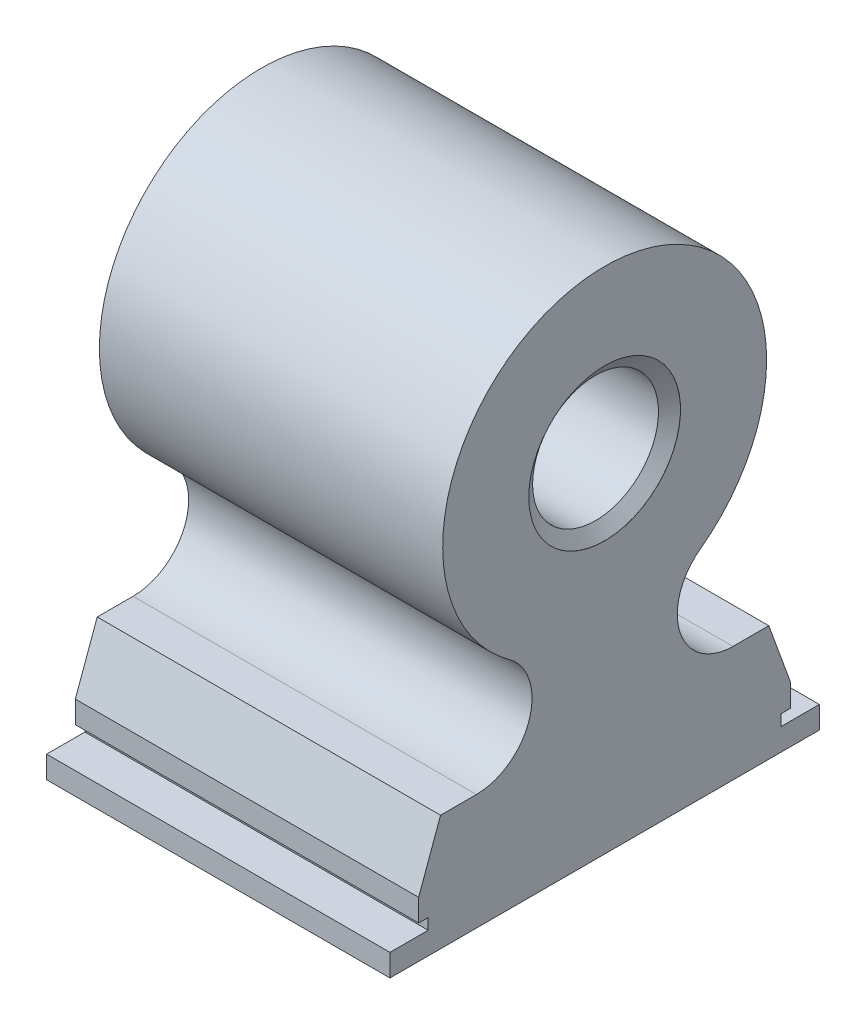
ISO-10303-21;
HEADER;
FILE_DESCRIPTION(('STEP AP214'),'2;1');
FILE_NAME('part.step','',(''),(''),'','','');
FILE_SCHEMA(('AUTOMOTIVE_DESIGN { 1 0 10303 214 1 1 1 1 }'));
ENDSEC;
DATA;
#1=APPLICATION_CONTEXT('core data for automotive mechanical design processes');
#2=APPLICATION_PROTOCOL_DEFINITION('international standard','automotive_design',2000,#1);
#3=PRODUCT_CONTEXT('',#1,'mechanical');
#4=PRODUCT('Part','Part','',(#3));
#5=PRODUCT_RELATED_PRODUCT_CATEGORY('part','',(#4));
#6=PRODUCT_DEFINITION_FORMATION('','',#4);
#7=PRODUCT_DEFINITION_CONTEXT('part definition',#1,'design');
#8=PRODUCT_DEFINITION('design','',#6,#7);
#9=PRODUCT_DEFINITION_SHAPE('','',#8);
#10=(LENGTH_UNIT() NAMED_UNIT(*) SI_UNIT(.MILLI.,.METRE.));
#11=(NAMED_UNIT(*) PLANE_ANGLE_UNIT() SI_UNIT($,.RADIAN.));
#12=(NAMED_UNIT(*) SI_UNIT($,.STERADIAN.) SOLID_ANGLE_UNIT());
#13=UNCERTAINTY_MEASURE_WITH_UNIT(LENGTH_MEASURE(1.E-05),#10,'distance_accuracy_value','');
#14=(GEOMETRIC_REPRESENTATION_CONTEXT(3) GLOBAL_UNCERTAINTY_ASSIGNED_CONTEXT((#13)) GLOBAL_UNIT_ASSIGNED_CONTEXT((#10,
#11,#12)) REPRESENTATION_CONTEXT('',''));
#15=CARTESIAN_POINT('',(0.,0.,0.));
#16=DIRECTION('',(0.,0.,1.));
#17=DIRECTION('',(1.,0.,0.));
#18=AXIS2_PLACEMENT_3D('',#15,#16,#17);
#19=CARTESIAN_POINT('',(9.4234,0.,0.));
#20=DIRECTION('',(-1.,0.,0.));
#21=DIRECTION('',(0.,0.,1.));
#22=AXIS2_PLACEMENT_3D('',#19,#20,#21);
#23=CYLINDRICAL_SURFACE('',#22,1.7272);
#24=CARTESIAN_POINT('',(0.251441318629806,0.,0.));
#25=DIRECTION('',(-1.,0.,0.));
#26=DIRECTION('',(0.,0.,1.));
#27=AXIS2_PLACEMENT_3D('',#24,#25,#26);
#28=CIRCLE('',#27,1.7272);
#29=CARTESIAN_POINT('',(0.251441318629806,0.,1.7272));
#30=VERTEX_POINT('',#29);
#31=EDGE_CURVE('E274',#30,#30,#28,.T.);
#32=ORIENTED_EDGE('',*,*,#31,.T.);
#33=EDGE_LOOP('',(#32));
#34=FACE_BOUND('',#33,.T.);
#35=CARTESIAN_POINT('',(9.17195868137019,0.,0.));
#36=DIRECTION('',(-1.,0.,0.));
#37=DIRECTION('',(0.,0.,1.));
#38=AXIS2_PLACEMENT_3D('',#35,#36,#37);
#39=CIRCLE('',#38,1.7272);
#40=CARTESIAN_POINT('',(9.17195868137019,0.,1.7272));
#41=VERTEX_POINT('',#40);
#42=EDGE_CURVE('E472',#41,#41,#39,.T.);
#43=ORIENTED_EDGE('',*,*,#42,.F.);
#44=EDGE_LOOP('',(#43));
#45=FACE_BOUND('',#44,.T.);
#46=ADVANCED_FACE('F33',(#34,#45),#23,.F.);
#47=CARTESIAN_POINT('',(9.4234,-4.82346177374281,3.52043822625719));
#48=DIRECTION('',(-1.,0.,0.));
#49=DIRECTION('',(0.,0.,1.));
#50=AXIS2_PLACEMENT_3D('',#47,#48,#49);
#51=PLANE('',#50);
#52=DIRECTION('',(0.,-1.,0.));
#53=VECTOR('',#52,1.);
#54=CARTESIAN_POINT('',(9.4234,-9.525,5.8928));
#55=LINE('',#54,#53);
#56=CARTESIAN_POINT('',(9.4234,-8.9154,5.8928));
#57=VERTEX_POINT('',#56);
#58=CARTESIAN_POINT('',(9.4234,-9.525,5.8928));
#59=VERTEX_POINT('',#58);
#60=EDGE_CURVE('E228',#57,#59,#55,.T.);
#61=ORIENTED_EDGE('',*,*,#60,.T.);
#62=DIRECTION('',(0.,0.,-1.));
#63=VECTOR('',#62,1.);
#64=CARTESIAN_POINT('',(9.4234,-9.525,5.8928));
#65=LINE('',#64,#63);
#66=CARTESIAN_POINT('',(9.4234,-9.525,-5.8928));
#67=VERTEX_POINT('',#66);
#68=EDGE_CURVE('E125',#59,#67,#65,.T.);
#69=ORIENTED_EDGE('',*,*,#68,.T.);
#70=DIRECTION('',(0.,1.,0.));
#71=VECTOR('',#70,1.);
#72=CARTESIAN_POINT('',(9.4234,-9.525,-5.8928));
#73=LINE('',#72,#71);
#74=CARTESIAN_POINT('',(9.4234,-8.9154,-5.8928));
#75=VERTEX_POINT('',#74);
#76=EDGE_CURVE('E284',#67,#75,#73,.T.);
#77=ORIENTED_EDGE('',*,*,#76,.T.);
#78=DIRECTION('',(0.,0.,1.));
#79=VECTOR('',#78,1.);
#80=CARTESIAN_POINT('',(9.4234,-8.9154,-5.8928));
#81=LINE('',#80,#79);
#82=CARTESIAN_POINT('',(9.4234,-8.9154,-4.84293333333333));
#83=VERTEX_POINT('',#82);
#84=EDGE_CURVE('E286',#75,#83,#81,.T.);
#85=ORIENTED_EDGE('',*,*,#84,.T.);
#86=DIRECTION('',(0.,1.,0.));
#87=VECTOR('',#86,1.);
#88=CARTESIAN_POINT('',(9.4234,-8.9154,-4.84293333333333));
#89=LINE('',#88,#87);
#90=CARTESIAN_POINT('',(9.4234,-8.6106,-4.84293333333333));
#91=VERTEX_POINT('',#90);
#92=EDGE_CURVE('E288',#83,#91,#89,.T.);
#93=ORIENTED_EDGE('',*,*,#92,.T.);
#94=DIRECTION('',(0.,0.,-1.));
#95=VECTOR('',#94,1.);
#96=CARTESIAN_POINT('',(9.4234,-8.6106,-4.84293333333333));
#97=LINE('',#96,#95);
#98=CARTESIAN_POINT('',(9.4234,-8.6106,-5.1054));
#99=VERTEX_POINT('',#98);
#100=EDGE_CURVE('E290',#91,#99,#97,.T.);
#101=ORIENTED_EDGE('',*,*,#100,.T.);
#102=DIRECTION('',(0.,1.,0.));
#103=VECTOR('',#102,1.);
#104=CARTESIAN_POINT('',(9.4234,-8.001,-5.1054));
#105=LINE('',#104,#103);
#106=CARTESIAN_POINT('',(9.4234,-8.001,-5.1054));
#107=VERTEX_POINT('',#106);
#108=EDGE_CURVE('E292',#99,#107,#105,.T.);
#109=ORIENTED_EDGE('',*,*,#108,.T.);
#110=DIRECTION('',(0.,0.939692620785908,0.34202014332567));
#111=VECTOR('',#110,1.);
#112=CARTESIAN_POINT('',(9.4234,-6.35,-4.5044851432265));
#113=LINE('',#112,#111);
#114=CARTESIAN_POINT('',(9.4234,-6.35,-4.5044851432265));
#115=VERTEX_POINT('',#114);
#116=EDGE_CURVE('E294',#107,#115,#113,.T.);
#117=ORIENTED_EDGE('',*,*,#116,.T.);
#118=DIRECTION('',(0.,0.,1.));
#119=VECTOR('',#118,1.);
#120=CARTESIAN_POINT('',(9.4234,-6.35,-4.5044851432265));
#121=LINE('',#120,#119);
#122=CARTESIAN_POINT('',(9.4234,-6.35,-3.52043822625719));
#123=VERTEX_POINT('',#122);
#124=EDGE_CURVE('E296',#115,#123,#121,.T.);
#125=ORIENTED_EDGE('',*,*,#124,.T.);
#126=CARTESIAN_POINT('',(9.4234,-4.82346177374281,-3.52043822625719));
#127=DIRECTION('',(-1.,0.,0.));
#128=DIRECTION('',(0.,0.,1.));
#129=AXIS2_PLACEMENT_3D('',#126,#127,#128);
#130=CIRCLE('',#129,1.5265382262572);
#131=CARTESIAN_POINT('',(9.4234,-3.59041285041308,-2.62048861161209));
#132=VERTEX_POINT('',#131);
#133=EDGE_CURVE('E298',#123,#132,#130,.T.);
#134=ORIENTED_EDGE('',*,*,#133,.T.);
#135=CARTESIAN_POINT('',(9.4234,0.,0.));
#136=DIRECTION('',(1.,0.,0.));
#137=DIRECTION('',(0.,0.,-1.));
#138=AXIS2_PLACEMENT_3D('',#135,#136,#137);
#139=CIRCLE('',#138,4.445);
#140=CARTESIAN_POINT('',(9.4234,-3.59041285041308,2.62048861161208));
#141=VERTEX_POINT('',#140);
#142=EDGE_CURVE('E300',#132,#141,#139,.T.);
#143=ORIENTED_EDGE('',*,*,#142,.T.);
#144=CARTESIAN_POINT('',(9.4234,-4.82346177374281,3.52043822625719));
#145=DIRECTION('',(-1.,0.,0.));
#146=DIRECTION('',(0.,0.,1.));
#147=AXIS2_PLACEMENT_3D('',#144,#145,#146);
#148=CIRCLE('',#147,1.5265382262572);
#149=CARTESIAN_POINT('',(9.4234,-6.35,3.52043822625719));
#150=VERTEX_POINT('',#149);
#151=EDGE_CURVE('E302',#141,#150,#148,.T.);
#152=ORIENTED_EDGE('',*,*,#151,.T.);
#153=DIRECTION('',(0.,0.,1.));
#154=VECTOR('',#153,1.);
#155=CARTESIAN_POINT('',(9.4234,-6.35,3.52043822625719));
#156=LINE('',#155,#154);
#157=CARTESIAN_POINT('',(9.4234,-6.35,4.5044851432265));
#158=VERTEX_POINT('',#157);
#159=EDGE_CURVE('E304',#150,#158,#156,.T.);
#160=ORIENTED_EDGE('',*,*,#159,.T.);
#161=DIRECTION('',(0.,-0.939692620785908,0.34202014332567));
#162=VECTOR('',#161,1.);
#163=CARTESIAN_POINT('',(9.4234,-6.35,4.5044851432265));
#164=LINE('',#163,#162);
#165=CARTESIAN_POINT('',(9.4234,-8.001,5.1054));
#166=VERTEX_POINT('',#165);
#167=EDGE_CURVE('E306',#158,#166,#164,.T.);
#168=ORIENTED_EDGE('',*,*,#167,.T.);
#169=DIRECTION('',(0.,-1.,0.));
#170=VECTOR('',#169,1.);
#171=CARTESIAN_POINT('',(9.4234,-8.001,5.1054));
#172=LINE('',#171,#170);
#173=CARTESIAN_POINT('',(9.4234,-8.6106,5.1054));
#174=VERTEX_POINT('',#173);
#175=EDGE_CURVE('E175',#166,#174,#172,.T.);
#176=ORIENTED_EDGE('',*,*,#175,.T.);
#177=DIRECTION('',(0.,0.,-1.));
#178=VECTOR('',#177,1.);
#179=CARTESIAN_POINT('',(9.4234,-8.6106,4.84293333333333));
#180=LINE('',#179,#178);
#181=CARTESIAN_POINT('',(9.4234,-8.6106,4.84293333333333));
#182=VERTEX_POINT('',#181);
#183=EDGE_CURVE('E168',#174,#182,#180,.T.);
#184=ORIENTED_EDGE('',*,*,#183,.T.);
#185=DIRECTION('',(0.,-1.,0.));
#186=VECTOR('',#185,1.);
#187=CARTESIAN_POINT('',(9.4234,-8.9154,4.84293333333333));
#188=LINE('',#187,#186);
#189=CARTESIAN_POINT('',(9.4234,-8.9154,4.84293333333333));
#190=VERTEX_POINT('',#189);
#191=EDGE_CURVE('E173',#182,#190,#188,.T.);
#192=ORIENTED_EDGE('',*,*,#191,.T.);
#193=DIRECTION('',(0.,0.,1.));
#194=VECTOR('',#193,1.);
#195=CARTESIAN_POINT('',(9.4234,-8.9154,5.8928));
#196=LINE('',#195,#194);
#197=EDGE_CURVE('E52',#190,#57,#196,.T.);
#198=ORIENTED_EDGE('',*,*,#197,.T.);
#199=EDGE_LOOP('',(#61,#69,#77,#85,#93,#101,#109,#117,#125,#134,#143,#152,#160,#168,#176,#184,
#192,#198));
#200=FACE_BOUND('',#199,.T.);
#201=CARTESIAN_POINT('',(9.4234,0.,0.));
#202=DIRECTION('',(-1.,0.,0.));
#203=DIRECTION('',(0.,0.,1.));
#204=AXIS2_PLACEMENT_3D('',#201,#202,#203);
#205=CIRCLE('',#204,2.0828);
#206=CARTESIAN_POINT('',(9.4234,0.,2.0828));
#207=VERTEX_POINT('',#206);
#208=EDGE_CURVE('E37',#207,#207,#205,.F.);
#209=ORIENTED_EDGE('',*,*,#208,.F.);
#210=EDGE_LOOP('',(#209));
#211=FACE_BOUND('',#210,.T.);
#212=ADVANCED_FACE('F170',(#200,#211),#51,.F.);
#213=CARTESIAN_POINT('',(0.,-4.82346177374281,3.52043822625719));
#214=DIRECTION('',(-1.,0.,0.));
#215=DIRECTION('',(0.,0.,1.));
#216=AXIS2_PLACEMENT_3D('',#213,#214,#215);
#217=PLANE('',#216);
#218=DIRECTION('',(0.,-1.,0.));
#219=VECTOR('',#218,1.);
#220=CARTESIAN_POINT('',(0.,-9.525,5.8928));
#221=LINE('',#220,#219);
#222=CARTESIAN_POINT('',(0.,-8.9154,5.8928));
#223=VERTEX_POINT('',#222);
#224=CARTESIAN_POINT('',(0.,-9.525,5.8928));
#225=VERTEX_POINT('',#224);
#226=EDGE_CURVE('E193',#223,#225,#221,.T.);
#227=ORIENTED_EDGE('',*,*,#226,.F.);
#228=DIRECTION('',(0.,0.,1.));
#229=VECTOR('',#228,1.);
#230=CARTESIAN_POINT('',(0.,-8.9154,5.8928));
#231=LINE('',#230,#229);
#232=CARTESIAN_POINT('',(0.,-8.9154,4.84293333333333));
#233=VERTEX_POINT('',#232);
#234=EDGE_CURVE('E117',#233,#223,#231,.T.);
#235=ORIENTED_EDGE('',*,*,#234,.F.);
#236=DIRECTION('',(0.,-1.,0.));
#237=VECTOR('',#236,1.);
#238=CARTESIAN_POINT('',(0.,-8.9154,4.84293333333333));
#239=LINE('',#238,#237);
#240=CARTESIAN_POINT('',(0.,-8.6106,4.84293333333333));
#241=VERTEX_POINT('',#240);
#242=EDGE_CURVE('E111',#241,#233,#239,.T.);
#243=ORIENTED_EDGE('',*,*,#242,.F.);
#244=DIRECTION('',(0.,0.,-1.));
#245=VECTOR('',#244,1.);
#246=CARTESIAN_POINT('',(0.,-8.6106,4.84293333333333));
#247=LINE('',#246,#245);
#248=CARTESIAN_POINT('',(0.,-8.6106,5.1054));
#249=VERTEX_POINT('',#248);
#250=EDGE_CURVE('E183',#249,#241,#247,.T.);
#251=ORIENTED_EDGE('',*,*,#250,.F.);
#252=DIRECTION('',(0.,-1.,0.));
#253=VECTOR('',#252,1.);
#254=CARTESIAN_POINT('',(0.,-8.001,5.1054));
#255=LINE('',#254,#253);
#256=CARTESIAN_POINT('',(0.,-8.001,5.1054));
#257=VERTEX_POINT('',#256);
#258=EDGE_CURVE('E223',#257,#249,#255,.T.);
#259=ORIENTED_EDGE('',*,*,#258,.F.);
#260=DIRECTION('',(0.,-0.939692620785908,0.34202014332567));
#261=VECTOR('',#260,1.);
#262=CARTESIAN_POINT('',(0.,-6.35,4.5044851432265));
#263=LINE('',#262,#261);
#264=CARTESIAN_POINT('',(0.,-6.35,4.5044851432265));
#265=VERTEX_POINT('',#264);
#266=EDGE_CURVE('E221',#265,#257,#263,.T.);
#267=ORIENTED_EDGE('',*,*,#266,.F.);
#268=DIRECTION('',(0.,0.,1.));
#269=VECTOR('',#268,1.);
#270=CARTESIAN_POINT('',(0.,-6.35,3.52043822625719));
#271=LINE('',#270,#269);
#272=CARTESIAN_POINT('',(0.,-6.35,3.52043822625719));
#273=VERTEX_POINT('',#272);
#274=EDGE_CURVE('E219',#273,#265,#271,.T.);
#275=ORIENTED_EDGE('',*,*,#274,.F.);
#276=CARTESIAN_POINT('',(0.,-4.82346177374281,3.52043822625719));
#277=DIRECTION('',(-1.,0.,0.));
#278=DIRECTION('',(0.,0.,1.));
#279=AXIS2_PLACEMENT_3D('',#276,#277,#278);
#280=CIRCLE('',#279,1.5265382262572);
#281=CARTESIAN_POINT('',(0.,-3.59041285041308,2.62048861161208));
#282=VERTEX_POINT('',#281);
#283=EDGE_CURVE('E217',#282,#273,#280,.T.);
#284=ORIENTED_EDGE('',*,*,#283,.F.);
#285=CARTESIAN_POINT('',(0.,0.,0.));
#286=DIRECTION('',(1.,0.,0.));
#287=DIRECTION('',(0.,0.,-1.));
#288=AXIS2_PLACEMENT_3D('',#285,#286,#287);
#289=CIRCLE('',#288,4.445);
#290=CARTESIAN_POINT('',(0.,-3.59041285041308,-2.62048861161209));
#291=VERTEX_POINT('',#290);
#292=EDGE_CURVE('E215',#291,#282,#289,.T.);
#293=ORIENTED_EDGE('',*,*,#292,.F.);
#294=CARTESIAN_POINT('',(0.,-4.82346177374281,-3.52043822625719));
#295=DIRECTION('',(-1.,0.,0.));
#296=DIRECTION('',(0.,0.,1.));
#297=AXIS2_PLACEMENT_3D('',#294,#295,#296);
#298=CIRCLE('',#297,1.5265382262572);
#299=CARTESIAN_POINT('',(0.,-6.35,-3.52043822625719));
#300=VERTEX_POINT('',#299);
#301=EDGE_CURVE('E213',#300,#291,#298,.T.);
#302=ORIENTED_EDGE('',*,*,#301,.F.);
#303=DIRECTION('',(0.,0.,1.));
#304=VECTOR('',#303,1.);
#305=CARTESIAN_POINT('',(0.,-6.35,-4.5044851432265));
#306=LINE('',#305,#304);
#307=CARTESIAN_POINT('',(0.,-6.35,-4.5044851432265));
#308=VERTEX_POINT('',#307);
#309=EDGE_CURVE('E211',#308,#300,#306,.T.);
#310=ORIENTED_EDGE('',*,*,#309,.F.);
#311=DIRECTION('',(0.,0.939692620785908,0.34202014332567));
#312=VECTOR('',#311,1.);
#313=CARTESIAN_POINT('',(0.,-6.35,-4.5044851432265));
#314=LINE('',#313,#312);
#315=CARTESIAN_POINT('',(0.,-8.001,-5.1054));
#316=VERTEX_POINT('',#315);
#317=EDGE_CURVE('E209',#316,#308,#314,.T.);
#318=ORIENTED_EDGE('',*,*,#317,.F.);
#319=DIRECTION('',(0.,1.,0.));
#320=VECTOR('',#319,1.);
#321=CARTESIAN_POINT('',(0.,-8.001,-5.1054));
#322=LINE('',#321,#320);
#323=CARTESIAN_POINT('',(0.,-8.6106,-5.1054));
#324=VERTEX_POINT('',#323);
#325=EDGE_CURVE('E207',#324,#316,#322,.T.);
#326=ORIENTED_EDGE('',*,*,#325,.F.);
#327=DIRECTION('',(0.,0.,-1.));
#328=VECTOR('',#327,1.);
#329=CARTESIAN_POINT('',(0.,-8.6106,-4.84293333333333));
#330=LINE('',#329,#328);
#331=CARTESIAN_POINT('',(0.,-8.6106,-4.84293333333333));
#332=VERTEX_POINT('',#331);
#333=EDGE_CURVE('E205',#332,#324,#330,.T.);
#334=ORIENTED_EDGE('',*,*,#333,.F.);
#335=DIRECTION('',(0.,1.,0.));
#336=VECTOR('',#335,1.);
#337=CARTESIAN_POINT('',(0.,-8.9154,-4.84293333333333));
#338=LINE('',#337,#336);
#339=CARTESIAN_POINT('',(0.,-8.9154,-4.84293333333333));
#340=VERTEX_POINT('',#339);
#341=EDGE_CURVE('E203',#340,#332,#338,.T.);
#342=ORIENTED_EDGE('',*,*,#341,.F.);
#343=DIRECTION('',(0.,0.,1.));
#344=VECTOR('',#343,1.);
#345=CARTESIAN_POINT('',(0.,-8.9154,-5.8928));
#346=LINE('',#345,#344);
#347=CARTESIAN_POINT('',(0.,-8.9154,-5.8928));
#348=VERTEX_POINT('',#347);
#349=EDGE_CURVE('E201',#348,#340,#346,.T.);
#350=ORIENTED_EDGE('',*,*,#349,.F.);
#351=DIRECTION('',(0.,1.,0.));
#352=VECTOR('',#351,1.);
#353=CARTESIAN_POINT('',(0.,-9.525,-5.8928));
#354=LINE('',#353,#352);
#355=CARTESIAN_POINT('',(0.,-9.525,-5.8928));
#356=VERTEX_POINT('',#355);
#357=EDGE_CURVE('E199',#356,#348,#354,.T.);
#358=ORIENTED_EDGE('',*,*,#357,.F.);
#359=DIRECTION('',(0.,0.,-1.));
#360=VECTOR('',#359,1.);
#361=CARTESIAN_POINT('',(0.,-9.525,5.8928));
#362=LINE('',#361,#360);
#363=EDGE_CURVE('E196',#225,#356,#362,.T.);
#364=ORIENTED_EDGE('',*,*,#363,.F.);
#365=EDGE_LOOP('',(#227,#235,#243,#251,#259,#267,#275,#284,#293,#302,#310,#318,#326,#334,#342,
#350,#358,#364));
#366=FACE_BOUND('',#365,.T.);
#367=CARTESIAN_POINT('',(0.,0.,0.));
#368=DIRECTION('',(-1.,0.,0.));
#369=DIRECTION('',(0.,0.,1.));
#370=AXIS2_PLACEMENT_3D('',#367,#368,#369);
#371=CIRCLE('',#370,2.0828);
#372=CARTESIAN_POINT('',(0.,0.,2.0828));
#373=VERTEX_POINT('',#372);
#374=EDGE_CURVE('E197',#373,#373,#371,.F.);
#375=ORIENTED_EDGE('',*,*,#374,.T.);
#376=EDGE_LOOP('',(#375));
#377=FACE_BOUND('',#376,.T.);
#378=ADVANCED_FACE('F319',(#366,#377),#217,.T.);
#379=CARTESIAN_POINT('',(9.4234,-9.525,5.8928));
#380=DIRECTION('',(0.,0.,-1.));
#381=DIRECTION('',(-1.,0.,0.));
#382=AXIS2_PLACEMENT_3D('',#379,#380,#381);
#383=PLANE('',#382);
#384=ORIENTED_EDGE('',*,*,#226,.T.);
#385=DIRECTION('',(-1.,0.,0.));
#386=VECTOR('',#385,1.);
#387=CARTESIAN_POINT('',(9.4234,-9.525,5.8928));
#388=LINE('',#387,#386);
#389=EDGE_CURVE('E11',#59,#225,#388,.T.);
#390=ORIENTED_EDGE('',*,*,#389,.F.);
#391=ORIENTED_EDGE('',*,*,#60,.F.);
#392=DIRECTION('',(-1.,0.,0.));
#393=VECTOR('',#392,1.);
#394=CARTESIAN_POINT('',(9.4234,-8.9154,5.8928));
#395=LINE('',#394,#393);
#396=EDGE_CURVE('E189',#57,#223,#395,.T.);
#397=ORIENTED_EDGE('',*,*,#396,.T.);
#398=EDGE_LOOP('',(#384,#390,#391,#397));
#399=FACE_BOUND('',#398,.T.);
#400=ADVANCED_FACE('F35',(#399),#383,.F.);
#401=CARTESIAN_POINT('',(9.4234,-9.525,5.8928));
#402=DIRECTION('',(0.,1.,0.));
#403=DIRECTION('',(0.,0.,1.));
#404=AXIS2_PLACEMENT_3D('',#401,#402,#403);
#405=PLANE('',#404);
#406=ORIENTED_EDGE('',*,*,#363,.T.);
#407=DIRECTION('',(-1.,0.,0.));
#408=VECTOR('',#407,1.);
#409=CARTESIAN_POINT('',(9.4234,-9.525,-5.8928));
#410=LINE('',#409,#408);
#411=EDGE_CURVE('E43',#67,#356,#410,.T.);
#412=ORIENTED_EDGE('',*,*,#411,.F.);
#413=ORIENTED_EDGE('',*,*,#68,.F.);
#414=ORIENTED_EDGE('',*,*,#389,.T.);
#415=EDGE_LOOP('',(#406,#412,#413,#414));
#416=FACE_BOUND('',#415,.T.);
#417=ADVANCED_FACE('F349',(#416),#405,.F.);
#418=CARTESIAN_POINT('',(9.4234,-9.525,-5.8928));
#419=DIRECTION('',(0.,0.,1.));
#420=DIRECTION('',(1.,0.,0.));
#421=AXIS2_PLACEMENT_3D('',#418,#419,#420);
#422=PLANE('',#421);
#423=ORIENTED_EDGE('',*,*,#357,.T.);
#424=DIRECTION('',(-1.,0.,0.));
#425=VECTOR('',#424,1.);
#426=CARTESIAN_POINT('',(9.4234,-8.9154,-5.8928));
#427=LINE('',#426,#425);
#428=EDGE_CURVE('E265',#75,#348,#427,.T.);
#429=ORIENTED_EDGE('',*,*,#428,.F.);
#430=ORIENTED_EDGE('',*,*,#76,.F.);
#431=ORIENTED_EDGE('',*,*,#411,.T.);
#432=EDGE_LOOP('',(#423,#429,#430,#431));
#433=FACE_BOUND('',#432,.T.);
#434=ADVANCED_FACE('F353',(#433),#422,.F.);
#435=CARTESIAN_POINT('',(9.4234,-8.9154,-5.8928));
#436=DIRECTION('',(0.,-1.,0.));
#437=DIRECTION('',(0.,0.,-1.));
#438=AXIS2_PLACEMENT_3D('',#435,#436,#437);
#439=PLANE('',#438);
#440=ORIENTED_EDGE('',*,*,#349,.T.);
#441=DIRECTION('',(-1.,0.,0.));
#442=VECTOR('',#441,1.);
#443=CARTESIAN_POINT('',(9.4234,-8.9154,-4.84293333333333));
#444=LINE('',#443,#442);
#445=EDGE_CURVE('E262',#83,#340,#444,.T.);
#446=ORIENTED_EDGE('',*,*,#445,.F.);
#447=ORIENTED_EDGE('',*,*,#84,.F.);
#448=ORIENTED_EDGE('',*,*,#428,.T.);
#449=EDGE_LOOP('',(#440,#446,#447,#448));
#450=FACE_BOUND('',#449,.T.);
#451=ADVANCED_FACE('F357',(#450),#439,.F.);
#452=CARTESIAN_POINT('',(9.4234,-8.9154,-4.84293333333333));
#453=DIRECTION('',(0.,0.,1.));
#454=DIRECTION('',(1.,0.,0.));
#455=AXIS2_PLACEMENT_3D('',#452,#453,#454);
#456=PLANE('',#455);
#457=ORIENTED_EDGE('',*,*,#341,.T.);
#458=DIRECTION('',(-1.,0.,0.));
#459=VECTOR('',#458,1.);
#460=CARTESIAN_POINT('',(9.4234,-8.6106,-4.84293333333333));
#461=LINE('',#460,#459);
#462=EDGE_CURVE('E259',#91,#332,#461,.T.);
#463=ORIENTED_EDGE('',*,*,#462,.F.);
#464=ORIENTED_EDGE('',*,*,#92,.F.);
#465=ORIENTED_EDGE('',*,*,#445,.T.);
#466=EDGE_LOOP('',(#457,#463,#464,#465));
#467=FACE_BOUND('',#466,.T.);
#468=ADVANCED_FACE('F363',(#467),#456,.F.);
#469=CARTESIAN_POINT('',(9.4234,-8.6106,-4.84293333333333));
#470=DIRECTION('',(0.,1.,0.));
#471=DIRECTION('',(0.,0.,1.));
#472=AXIS2_PLACEMENT_3D('',#469,#470,#471);
#473=PLANE('',#472);
#474=ORIENTED_EDGE('',*,*,#333,.T.);
#475=DIRECTION('',(-1.,0.,0.));
#476=VECTOR('',#475,1.);
#477=CARTESIAN_POINT('',(9.4234,-8.6106,-5.1054));
#478=LINE('',#477,#476);
#479=EDGE_CURVE('E256',#99,#324,#478,.T.);
#480=ORIENTED_EDGE('',*,*,#479,.F.);
#481=ORIENTED_EDGE('',*,*,#100,.F.);
#482=ORIENTED_EDGE('',*,*,#462,.T.);
#483=EDGE_LOOP('',(#474,#480,#481,#482));
#484=FACE_BOUND('',#483,.T.);
#485=ADVANCED_FACE('F367',(#484),#473,.F.);
#486=CARTESIAN_POINT('',(9.4234,-8.001,-5.1054));
#487=DIRECTION('',(0.,0.,1.));
#488=DIRECTION('',(1.,0.,0.));
#489=AXIS2_PLACEMENT_3D('',#486,#487,#488);
#490=PLANE('',#489);
#491=ORIENTED_EDGE('',*,*,#325,.T.);
#492=DIRECTION('',(-1.,0.,0.));
#493=VECTOR('',#492,1.);
#494=CARTESIAN_POINT('',(9.4234,-8.001,-5.1054));
#495=LINE('',#494,#493);
#496=EDGE_CURVE('E253',#107,#316,#495,.T.);
#497=ORIENTED_EDGE('',*,*,#496,.F.);
#498=ORIENTED_EDGE('',*,*,#108,.F.);
#499=ORIENTED_EDGE('',*,*,#479,.T.);
#500=EDGE_LOOP('',(#491,#497,#498,#499));
#501=FACE_BOUND('',#500,.T.);
#502=ADVANCED_FACE('F371',(#501),#490,.F.);
#503=CARTESIAN_POINT('',(9.4234,-6.35,-4.5044851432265));
#504=DIRECTION('',(0.,-0.34202014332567,0.939692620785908));
#505=DIRECTION('',(0.,-0.939692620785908,-0.34202014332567));
#506=AXIS2_PLACEMENT_3D('',#503,#504,#505);
#507=PLANE('',#506);
#508=ORIENTED_EDGE('',*,*,#317,.T.);
#509=DIRECTION('',(-1.,0.,0.));
#510=VECTOR('',#509,1.);
#511=CARTESIAN_POINT('',(9.4234,-6.35,-4.5044851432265));
#512=LINE('',#511,#510);
#513=EDGE_CURVE('E250',#115,#308,#512,.T.);
#514=ORIENTED_EDGE('',*,*,#513,.F.);
#515=ORIENTED_EDGE('',*,*,#116,.F.);
#516=ORIENTED_EDGE('',*,*,#496,.T.);
#517=EDGE_LOOP('',(#508,#514,#515,#516));
#518=FACE_BOUND('',#517,.T.);
#519=ADVANCED_FACE('F375',(#518),#507,.F.);
#520=CARTESIAN_POINT('',(9.4234,-6.35,-4.5044851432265));
#521=DIRECTION('',(0.,-1.,0.));
#522=DIRECTION('',(0.,0.,-1.));
#523=AXIS2_PLACEMENT_3D('',#520,#521,#522);
#524=PLANE('',#523);
#525=ORIENTED_EDGE('',*,*,#309,.T.);
#526=DIRECTION('',(-1.,0.,0.));
#527=VECTOR('',#526,1.);
#528=CARTESIAN_POINT('',(9.4234,-6.35,-3.52043822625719));
#529=LINE('',#528,#527);
#530=EDGE_CURVE('E247',#123,#300,#529,.T.);
#531=ORIENTED_EDGE('',*,*,#530,.F.);
#532=ORIENTED_EDGE('',*,*,#124,.F.);
#533=ORIENTED_EDGE('',*,*,#513,.T.);
#534=EDGE_LOOP('',(#525,#531,#532,#533));
#535=FACE_BOUND('',#534,.T.);
#536=ADVANCED_FACE('F379',(#535),#524,.F.);
#537=CARTESIAN_POINT('',(9.4234,-4.82346177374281,-3.52043822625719));
#538=DIRECTION('',(-1.,0.,0.));
#539=DIRECTION('',(0.,0.,1.));
#540=AXIS2_PLACEMENT_3D('',#537,#538,#539);
#541=CYLINDRICAL_SURFACE('',#540,1.5265382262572);
#542=ORIENTED_EDGE('',*,*,#301,.T.);
#543=DIRECTION('',(-1.,0.,0.));
#544=VECTOR('',#543,1.);
#545=CARTESIAN_POINT('',(9.4234,-3.59041285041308,-2.62048861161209));
#546=LINE('',#545,#544);
#547=EDGE_CURVE('E244',#132,#291,#546,.T.);
#548=ORIENTED_EDGE('',*,*,#547,.F.);
#549=ORIENTED_EDGE('',*,*,#133,.F.);
#550=ORIENTED_EDGE('',*,*,#530,.T.);
#551=EDGE_LOOP('',(#542,#548,#549,#550));
#552=FACE_BOUND('',#551,.T.);
#553=ADVANCED_FACE('F383',(#552),#541,.F.);
#554=CARTESIAN_POINT('',(9.4234,0.,0.));
#555=DIRECTION('',(-1.,0.,0.));
#556=DIRECTION('',(0.,0.,1.));
#557=AXIS2_PLACEMENT_3D('',#554,#555,#556);
#558=CYLINDRICAL_SURFACE('',#557,4.445);
#559=ORIENTED_EDGE('',*,*,#292,.T.);
#560=DIRECTION('',(-1.,0.,0.));
#561=VECTOR('',#560,1.);
#562=CARTESIAN_POINT('',(9.4234,-3.59041285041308,2.62048861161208));
#563=LINE('',#562,#561);
#564=EDGE_CURVE('E241',#141,#282,#563,.T.);
#565=ORIENTED_EDGE('',*,*,#564,.F.);
#566=ORIENTED_EDGE('',*,*,#142,.F.);
#567=ORIENTED_EDGE('',*,*,#547,.T.);
#568=EDGE_LOOP('',(#559,#565,#566,#567));
#569=FACE_BOUND('',#568,.T.);
#570=ADVANCED_FACE('F387',(#569),#558,.T.);
#571=CARTESIAN_POINT('',(9.4234,-4.82346177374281,3.52043822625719));
#572=DIRECTION('',(-1.,0.,0.));
#573=DIRECTION('',(0.,0.,1.));
#574=AXIS2_PLACEMENT_3D('',#571,#572,#573);
#575=CYLINDRICAL_SURFACE('',#574,1.5265382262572);
#576=ORIENTED_EDGE('',*,*,#283,.T.);
#577=DIRECTION('',(-1.,0.,0.));
#578=VECTOR('',#577,1.);
#579=CARTESIAN_POINT('',(9.4234,-6.35,3.52043822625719));
#580=LINE('',#579,#578);
#581=EDGE_CURVE('E238',#150,#273,#580,.T.);
#582=ORIENTED_EDGE('',*,*,#581,.F.);
#583=ORIENTED_EDGE('',*,*,#151,.F.);
#584=ORIENTED_EDGE('',*,*,#564,.T.);
#585=EDGE_LOOP('',(#576,#582,#583,#584));
#586=FACE_BOUND('',#585,.T.);
#587=ADVANCED_FACE('F391',(#586),#575,.F.);
#588=CARTESIAN_POINT('',(9.4234,-6.35,3.52043822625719));
#589=DIRECTION('',(0.,-1.,0.));
#590=DIRECTION('',(0.,0.,-1.));
#591=AXIS2_PLACEMENT_3D('',#588,#589,#590);
#592=PLANE('',#591);
#593=ORIENTED_EDGE('',*,*,#274,.T.);
#594=DIRECTION('',(-1.,0.,0.));
#595=VECTOR('',#594,1.);
#596=CARTESIAN_POINT('',(9.4234,-6.35,4.5044851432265));
#597=LINE('',#596,#595);
#598=EDGE_CURVE('E235',#158,#265,#597,.T.);
#599=ORIENTED_EDGE('',*,*,#598,.F.);
#600=ORIENTED_EDGE('',*,*,#159,.F.);
#601=ORIENTED_EDGE('',*,*,#581,.T.);
#602=EDGE_LOOP('',(#593,#599,#600,#601));
#603=FACE_BOUND('',#602,.T.);
#604=ADVANCED_FACE('F395',(#603),#592,.F.);
#605=CARTESIAN_POINT('',(9.4234,-6.35,4.5044851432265));
#606=DIRECTION('',(0.,-0.34202014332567,-0.939692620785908));
#607=DIRECTION('',(0.,0.939692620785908,-0.34202014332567));
#608=AXIS2_PLACEMENT_3D('',#605,#606,#607);
#609=PLANE('',#608);
#610=ORIENTED_EDGE('',*,*,#266,.T.);
#611=DIRECTION('',(-1.,0.,0.));
#612=VECTOR('',#611,1.);
#613=CARTESIAN_POINT('',(9.4234,-8.001,5.1054));
#614=LINE('',#613,#612);
#615=EDGE_CURVE('E232',#166,#257,#614,.T.);
#616=ORIENTED_EDGE('',*,*,#615,.F.);
#617=ORIENTED_EDGE('',*,*,#167,.F.);
#618=ORIENTED_EDGE('',*,*,#598,.T.);
#619=EDGE_LOOP('',(#610,#616,#617,#618));
#620=FACE_BOUND('',#619,.T.);
#621=ADVANCED_FACE('F312',(#620),#609,.F.);
#622=CARTESIAN_POINT('',(9.4234,-8.001,5.1054));
#623=DIRECTION('',(0.,0.,-1.));
#624=DIRECTION('',(-1.,0.,0.));
#625=AXIS2_PLACEMENT_3D('',#622,#623,#624);
#626=PLANE('',#625);
#627=ORIENTED_EDGE('',*,*,#258,.T.);
#628=DIRECTION('',(-1.,0.,0.));
#629=VECTOR('',#628,1.);
#630=CARTESIAN_POINT('',(9.4234,-8.6106,5.1054));
#631=LINE('',#630,#629);
#632=EDGE_CURVE('E184',#174,#249,#631,.T.);
#633=ORIENTED_EDGE('',*,*,#632,.F.);
#634=ORIENTED_EDGE('',*,*,#175,.F.);
#635=ORIENTED_EDGE('',*,*,#615,.T.);
#636=EDGE_LOOP('',(#627,#633,#634,#635));
#637=FACE_BOUND('',#636,.T.);
#638=ADVANCED_FACE('F316',(#637),#626,.F.);
#639=CARTESIAN_POINT('',(9.4234,-8.6106,4.84293333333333));
#640=DIRECTION('',(0.,1.,0.));
#641=DIRECTION('',(0.,0.,1.));
#642=AXIS2_PLACEMENT_3D('',#639,#640,#641);
#643=PLANE('',#642);
#644=ORIENTED_EDGE('',*,*,#250,.T.);
#645=DIRECTION('',(-1.,0.,0.));
#646=VECTOR('',#645,1.);
#647=CARTESIAN_POINT('',(9.4234,-8.6106,4.84293333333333));
#648=LINE('',#647,#646);
#649=EDGE_CURVE('E180',#182,#241,#648,.T.);
#650=ORIENTED_EDGE('',*,*,#649,.F.);
#651=ORIENTED_EDGE('',*,*,#183,.F.);
#652=ORIENTED_EDGE('',*,*,#632,.T.);
#653=EDGE_LOOP('',(#644,#650,#651,#652));
#654=FACE_BOUND('',#653,.T.);
#655=ADVANCED_FACE('F181',(#654),#643,.F.);
#656=CARTESIAN_POINT('',(9.4234,-8.9154,4.84293333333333));
#657=DIRECTION('',(0.,0.,-1.));
#658=DIRECTION('',(-1.,0.,0.));
#659=AXIS2_PLACEMENT_3D('',#656,#657,#658);
#660=PLANE('',#659);
#661=ORIENTED_EDGE('',*,*,#242,.T.);
#662=DIRECTION('',(-1.,0.,0.));
#663=VECTOR('',#662,1.);
#664=CARTESIAN_POINT('',(9.4234,-8.9154,4.84293333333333));
#665=LINE('',#664,#663);
#666=EDGE_CURVE('E185',#190,#233,#665,.T.);
#667=ORIENTED_EDGE('',*,*,#666,.F.);
#668=ORIENTED_EDGE('',*,*,#191,.F.);
#669=ORIENTED_EDGE('',*,*,#649,.T.);
#670=EDGE_LOOP('',(#661,#667,#668,#669));
#671=FACE_BOUND('',#670,.T.);
#672=ADVANCED_FACE('F187',(#671),#660,.F.);
#673=CARTESIAN_POINT('',(9.4234,-8.9154,5.8928));
#674=DIRECTION('',(0.,-1.,0.));
#675=DIRECTION('',(0.,0.,-1.));
#676=AXIS2_PLACEMENT_3D('',#673,#674,#675);
#677=PLANE('',#676);
#678=ORIENTED_EDGE('',*,*,#234,.T.);
#679=ORIENTED_EDGE('',*,*,#396,.F.);
#680=ORIENTED_EDGE('',*,*,#197,.F.);
#681=ORIENTED_EDGE('',*,*,#666,.T.);
#682=EDGE_LOOP('',(#678,#679,#680,#681));
#683=FACE_BOUND('',#682,.T.);
#684=ADVANCED_FACE('F324',(#683),#677,.F.);
#685=CARTESIAN_POINT('',(0.251441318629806,0.,0.));
#686=DIRECTION('',(-1.,0.,0.));
#687=DIRECTION('',(0.,0.,1.));
#688=AXIS2_PLACEMENT_3D('',#685,#686,#687);
#689=CONICAL_SURFACE('',#688,1.7272,0.960105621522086);
#690=CARTESIAN_POINT('',(0.00254000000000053,0.,0.));
#691=DIRECTION('',(-1.,0.,0.));
#692=DIRECTION('',(0.,0.,1.));
#693=AXIS2_PLACEMENT_3D('',#690,#691,#692);
#694=CIRCLE('',#693,2.0828);
#695=CARTESIAN_POINT('',(0.00254000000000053,0.,2.0828));
#696=VERTEX_POINT('',#695);
#697=EDGE_CURVE('E270',#696,#696,#694,.T.);
#698=ORIENTED_EDGE('',*,*,#697,.T.);
#699=EDGE_LOOP('',(#698));
#700=FACE_BOUND('',#699,.T.);
#701=ORIENTED_EDGE('',*,*,#31,.F.);
#702=EDGE_LOOP('',(#701));
#703=FACE_BOUND('',#702,.T.);
#704=ADVANCED_FACE('F326',(#700,#703),#689,.F.);
#705=CARTESIAN_POINT('',(-5.10587962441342,0.,0.));
#706=DIRECTION('',(-1.,0.,0.));
#707=DIRECTION('',(0.,0.,1.));
#708=AXIS2_PLACEMENT_3D('',#705,#706,#707);
#709=CYLINDRICAL_SURFACE('',#708,2.0828);
#710=ORIENTED_EDGE('',*,*,#374,.F.);
#711=EDGE_LOOP('',(#710));
#712=FACE_BOUND('',#711,.T.);
#713=ORIENTED_EDGE('',*,*,#697,.F.);
#714=EDGE_LOOP('',(#713));
#715=FACE_BOUND('',#714,.T.);
#716=ADVANCED_FACE('F332',(#712,#715),#709,.F.);
#717=CARTESIAN_POINT('',(-5.10587962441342,0.,0.));
#718=DIRECTION('',(-1.,0.,0.));
#719=DIRECTION('',(0.,0.,1.));
#720=AXIS2_PLACEMENT_3D('',#717,#718,#719);
#721=CYLINDRICAL_SURFACE('',#720,2.0828);
#722=CARTESIAN_POINT('',(9.42086,0.,0.));
#723=DIRECTION('',(-1.,0.,0.));
#724=DIRECTION('',(0.,0.,1.));
#725=AXIS2_PLACEMENT_3D('',#722,#723,#724);
#726=CIRCLE('',#725,2.0828);
#727=CARTESIAN_POINT('',(9.42086,0.,2.0828));
#728=VERTEX_POINT('',#727);
#729=EDGE_CURVE('E475',#728,#728,#726,.T.);
#730=ORIENTED_EDGE('',*,*,#729,.T.);
#731=EDGE_LOOP('',(#730));
#732=FACE_BOUND('',#731,.T.);
#733=ORIENTED_EDGE('',*,*,#208,.T.);
#734=EDGE_LOOP('',(#733));
#735=FACE_BOUND('',#734,.T.);
#736=ADVANCED_FACE('F446',(#732,#735),#721,.F.);
#737=CARTESIAN_POINT('',(9.42086,0.,0.));
#738=DIRECTION('',(1.,0.,0.));
#739=DIRECTION('',(0.,0.,-1.));
#740=AXIS2_PLACEMENT_3D('',#737,#738,#739);
#741=CONICAL_SURFACE('',#740,2.0828,0.960105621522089);
#742=ORIENTED_EDGE('',*,*,#42,.T.);
#743=EDGE_LOOP('',(#742));
#744=FACE_BOUND('',#743,.T.);
#745=ORIENTED_EDGE('',*,*,#729,.F.);
#746=EDGE_LOOP('',(#745));
#747=FACE_BOUND('',#746,.T.);
#748=ADVANCED_FACE('F455',(#744,#747),#741,.F.);
#749=CLOSED_SHELL('',(#46,#212,#378,#400,#417,#434,#451,#468,#485,#502,#519,#536,#553,#570,#587,
#604,#621,#638,#655,#672,#684,#704,#716,#736,#748));
#750=MANIFOLD_SOLID_BREP('B2',#749);
#751=ADVANCED_BREP_SHAPE_REPRESENTATION('',(#18,#750),#14);
#752=SHAPE_DEFINITION_REPRESENTATION(#9,#751);
ENDSEC;
END-ISO-10303-21;
